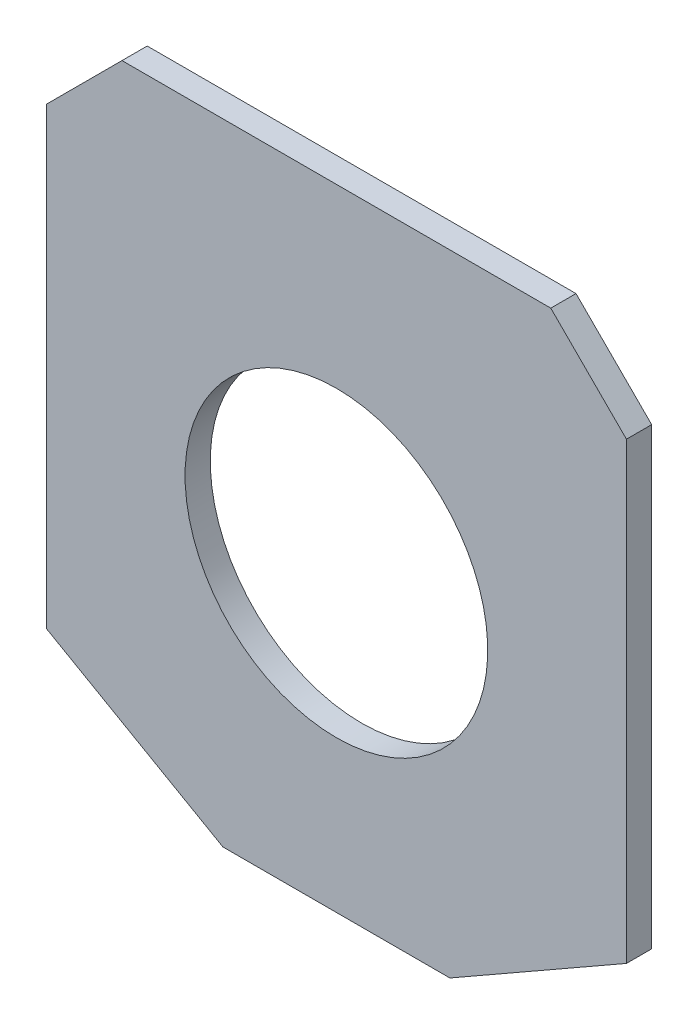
ISO-10303-21;
HEADER;
FILE_DESCRIPTION(('STEP AP214'),'2;1');
FILE_NAME('part.step','',(''),(''),'','','');
FILE_SCHEMA(('AUTOMOTIVE_DESIGN { 1 0 10303 214 1 1 1 1 }'));
ENDSEC;
DATA;
#1=APPLICATION_CONTEXT('core data for automotive mechanical design processes');
#2=APPLICATION_PROTOCOL_DEFINITION('international standard','automotive_design',2000,#1);
#3=PRODUCT_CONTEXT('',#1,'mechanical');
#4=PRODUCT('Part','Part','',(#3));
#5=PRODUCT_RELATED_PRODUCT_CATEGORY('part','',(#4));
#6=PRODUCT_DEFINITION_FORMATION('','',#4);
#7=PRODUCT_DEFINITION_CONTEXT('part definition',#1,'design');
#8=PRODUCT_DEFINITION('design','',#6,#7);
#9=PRODUCT_DEFINITION_SHAPE('','',#8);
#10=(LENGTH_UNIT() NAMED_UNIT(*) SI_UNIT(.MILLI.,.METRE.));
#11=(NAMED_UNIT(*) PLANE_ANGLE_UNIT() SI_UNIT($,.RADIAN.));
#12=(NAMED_UNIT(*) SI_UNIT($,.STERADIAN.) SOLID_ANGLE_UNIT());
#13=UNCERTAINTY_MEASURE_WITH_UNIT(LENGTH_MEASURE(1.E-05),#10,'distance_accuracy_value','');
#14=(GEOMETRIC_REPRESENTATION_CONTEXT(3) GLOBAL_UNCERTAINTY_ASSIGNED_CONTEXT((#13)) GLOBAL_UNIT_ASSIGNED_CONTEXT((#10,
#11,#12)) REPRESENTATION_CONTEXT('',''));
#15=CARTESIAN_POINT('',(0.,0.,0.));
#16=DIRECTION('',(0.,0.,1.));
#17=DIRECTION('',(1.,0.,0.));
#18=AXIS2_PLACEMENT_3D('',#15,#16,#17);
#19=CARTESIAN_POINT('',(83.011527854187,-96.2278115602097,0.));
#20=DIRECTION('',(0.,0.,1.));
#21=DIRECTION('',(1.,0.,0.));
#22=AXIS2_PLACEMENT_3D('',#19,#20,#21);
#23=PLANE('',#22);
#24=CARTESIAN_POINT('',(83.011527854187,-106.08069009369,0.));
#25=DIRECTION('',(0.,0.,-1.));
#26=DIRECTION('',(0.,1.,0.));
#27=AXIS2_PLACEMENT_3D('',#24,#25,#26);
#28=CIRCLE('',#27,60.);
#29=CARTESIAN_POINT('',(83.011527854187,-46.0806900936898,0.));
#30=VERTEX_POINT('',#29);
#31=EDGE_CURVE('E20',#30,#30,#28,.F.);
#32=ORIENTED_EDGE('',*,*,#31,.T.);
#33=EDGE_LOOP('',(#32));
#34=FACE_BOUND('',#33,.T.);
#35=DIRECTION('',(0.,1.,0.));
#36=VECTOR('',#35,1.);
#37=CARTESIAN_POINT('',(-31.988472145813,-186.08069009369,0.));
#38=LINE('',#37,#36);
#39=CARTESIAN_POINT('',(-31.988472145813,-6.08069009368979,0.));
#40=VERTEX_POINT('',#39);
#41=CARTESIAN_POINT('',(-31.988472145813,-186.08069009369,0.));
#42=VERTEX_POINT('',#41);
#43=EDGE_CURVE('E67',#40,#42,#38,.F.);
#44=ORIENTED_EDGE('',*,*,#43,.F.);
#45=DIRECTION('',(-0.707106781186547,-0.707106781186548,0.));
#46=VECTOR('',#45,1.);
#47=CARTESIAN_POINT('',(-31.988472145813,-6.08069009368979,0.));
#48=LINE('',#47,#46);
#49=CARTESIAN_POINT('',(-1.98847214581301,23.9193099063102,0.));
#50=VERTEX_POINT('',#49);
#51=EDGE_CURVE('E128',#50,#40,#48,.T.);
#52=ORIENTED_EDGE('',*,*,#51,.F.);
#53=DIRECTION('',(1.,0.,0.));
#54=VECTOR('',#53,1.);
#55=CARTESIAN_POINT('',(-1.98847214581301,23.9193099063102,0.));
#56=LINE('',#55,#54);
#57=CARTESIAN_POINT('',(168.011527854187,23.9193099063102,0.));
#58=VERTEX_POINT('',#57);
#59=EDGE_CURVE('E123',#58,#50,#56,.F.);
#60=ORIENTED_EDGE('',*,*,#59,.F.);
#61=DIRECTION('',(-0.707106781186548,0.707106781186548,0.));
#62=VECTOR('',#61,1.);
#63=CARTESIAN_POINT('',(168.011527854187,23.9193099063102,0.));
#64=LINE('',#63,#62);
#65=CARTESIAN_POINT('',(198.011527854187,-6.08069009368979,0.));
#66=VERTEX_POINT('',#65);
#67=EDGE_CURVE('E118',#66,#58,#64,.T.);
#68=ORIENTED_EDGE('',*,*,#67,.F.);
#69=DIRECTION('',(0.,1.,0.));
#70=VECTOR('',#69,1.);
#71=CARTESIAN_POINT('',(198.011527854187,-6.08069009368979,0.));
#72=LINE('',#71,#70);
#73=CARTESIAN_POINT('',(198.011527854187,-186.08069009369,0.));
#74=VERTEX_POINT('',#73);
#75=EDGE_CURVE('E113',#74,#66,#72,.T.);
#76=ORIENTED_EDGE('',*,*,#75,.F.);
#77=DIRECTION('',(0.868243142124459,0.496138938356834,0.));
#78=VECTOR('',#77,1.);
#79=CARTESIAN_POINT('',(198.011527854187,-186.08069009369,0.));
#80=LINE('',#79,#78);
#81=CARTESIAN_POINT('',(128.011527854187,-226.08069009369,0.));
#82=VERTEX_POINT('',#81);
#83=EDGE_CURVE('E108',#82,#74,#80,.T.);
#84=ORIENTED_EDGE('',*,*,#83,.F.);
#85=DIRECTION('',(1.,0.,0.));
#86=VECTOR('',#85,1.);
#87=CARTESIAN_POINT('',(128.011527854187,-226.08069009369,0.));
#88=LINE('',#87,#86);
#89=CARTESIAN_POINT('',(38.011527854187,-226.08069009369,0.));
#90=VERTEX_POINT('',#89);
#91=EDGE_CURVE('E95',#90,#82,#88,.T.);
#92=ORIENTED_EDGE('',*,*,#91,.F.);
#93=DIRECTION('',(0.868243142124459,-0.496138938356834,0.));
#94=VECTOR('',#93,1.);
#95=CARTESIAN_POINT('',(38.011527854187,-226.08069009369,0.));
#96=LINE('',#95,#94);
#97=EDGE_CURVE('E93',#42,#90,#96,.T.);
#98=ORIENTED_EDGE('',*,*,#97,.F.);
#99=EDGE_LOOP('',(#44,#52,#60,#68,#76,#84,#92,#98));
#100=FACE_BOUND('',#99,.T.);
#101=ADVANCED_FACE('F16',(#34,#100),#23,.F.);
#102=CARTESIAN_POINT('',(-31.988472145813,-186.08069009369,0.));
#103=DIRECTION('',(-1.,0.,0.));
#104=DIRECTION('',(0.,0.,1.));
#105=AXIS2_PLACEMENT_3D('',#102,#103,#104);
#106=PLANE('',#105);
#107=ORIENTED_EDGE('',*,*,#43,.T.);
#108=DIRECTION('',(0.,0.,1.));
#109=VECTOR('',#108,1.);
#110=CARTESIAN_POINT('',(-31.988472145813,-186.08069009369,0.));
#111=LINE('',#110,#109);
#112=CARTESIAN_POINT('',(-31.988472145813,-186.08069009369,10.));
#113=VERTEX_POINT('',#112);
#114=EDGE_CURVE('E87',#113,#42,#111,.F.);
#115=ORIENTED_EDGE('',*,*,#114,.F.);
#116=DIRECTION('',(0.,1.,0.));
#117=VECTOR('',#116,1.);
#118=CARTESIAN_POINT('',(-31.988472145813,-96.2278115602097,10.));
#119=LINE('',#118,#117);
#120=CARTESIAN_POINT('',(-31.988472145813,-6.08069009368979,10.));
#121=VERTEX_POINT('',#120);
#122=EDGE_CURVE('E60',#121,#113,#119,.F.);
#123=ORIENTED_EDGE('',*,*,#122,.F.);
#124=DIRECTION('',(0.,0.,1.));
#125=VECTOR('',#124,1.);
#126=CARTESIAN_POINT('',(-31.988472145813,-6.08069009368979,0.));
#127=LINE('',#126,#125);
#128=EDGE_CURVE('E89',#40,#121,#127,.T.);
#129=ORIENTED_EDGE('',*,*,#128,.F.);
#130=EDGE_LOOP('',(#107,#115,#123,#129));
#131=FACE_BOUND('',#130,.T.);
#132=ADVANCED_FACE('F85',(#131),#106,.T.);
#133=CARTESIAN_POINT('',(38.011527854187,-226.08069009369,0.));
#134=DIRECTION('',(-0.496138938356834,-0.868243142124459,0.));
#135=DIRECTION('',(0.868243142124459,-0.496138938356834,0.));
#136=AXIS2_PLACEMENT_3D('',#133,#134,#135);
#137=PLANE('',#136);
#138=ORIENTED_EDGE('',*,*,#97,.T.);
#139=DIRECTION('',(0.,0.,-1.));
#140=VECTOR('',#139,1.);
#141=CARTESIAN_POINT('',(38.011527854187,-226.08069009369,0.));
#142=LINE('',#141,#140);
#143=CARTESIAN_POINT('',(38.011527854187,-226.08069009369,10.));
#144=VERTEX_POINT('',#143);
#145=EDGE_CURVE('E98',#144,#90,#142,.T.);
#146=ORIENTED_EDGE('',*,*,#145,.F.);
#147=DIRECTION('',(0.868243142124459,-0.496138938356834,0.));
#148=VECTOR('',#147,1.);
#149=CARTESIAN_POINT('',(-31.9884721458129,-186.08069009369,10.));
#150=LINE('',#149,#148);
#151=EDGE_CURVE('E102',#113,#144,#150,.T.);
#152=ORIENTED_EDGE('',*,*,#151,.F.);
#153=ORIENTED_EDGE('',*,*,#114,.T.);
#154=EDGE_LOOP('',(#138,#146,#152,#153));
#155=FACE_BOUND('',#154,.T.);
#156=ADVANCED_FACE('F100',(#155),#137,.T.);
#157=CARTESIAN_POINT('',(128.011527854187,-226.08069009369,0.));
#158=DIRECTION('',(0.,-1.,0.));
#159=DIRECTION('',(0.,0.,-1.));
#160=AXIS2_PLACEMENT_3D('',#157,#158,#159);
#161=PLANE('',#160);
#162=ORIENTED_EDGE('',*,*,#91,.T.);
#163=DIRECTION('',(0.,0.,1.));
#164=VECTOR('',#163,1.);
#165=CARTESIAN_POINT('',(128.011527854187,-226.08069009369,0.));
#166=LINE('',#165,#164);
#167=CARTESIAN_POINT('',(128.011527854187,-226.08069009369,10.));
#168=VERTEX_POINT('',#167);
#169=EDGE_CURVE('E106',#168,#82,#166,.F.);
#170=ORIENTED_EDGE('',*,*,#169,.F.);
#171=DIRECTION('',(1.,0.,0.));
#172=VECTOR('',#171,1.);
#173=CARTESIAN_POINT('',(83.011527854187,-226.08069009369,10.));
#174=LINE('',#173,#172);
#175=EDGE_CURVE('E145',#144,#168,#174,.T.);
#176=ORIENTED_EDGE('',*,*,#175,.F.);
#177=ORIENTED_EDGE('',*,*,#145,.T.);
#178=EDGE_LOOP('',(#162,#170,#176,#177));
#179=FACE_BOUND('',#178,.T.);
#180=ADVANCED_FACE('F181',(#179),#161,.T.);
#181=CARTESIAN_POINT('',(198.011527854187,-186.08069009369,0.));
#182=DIRECTION('',(0.496138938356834,-0.868243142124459,0.));
#183=DIRECTION('',(0.868243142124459,0.496138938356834,0.));
#184=AXIS2_PLACEMENT_3D('',#181,#182,#183);
#185=PLANE('',#184);
#186=ORIENTED_EDGE('',*,*,#83,.T.);
#187=DIRECTION('',(0.,0.,-1.));
#188=VECTOR('',#187,1.);
#189=CARTESIAN_POINT('',(198.011527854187,-186.08069009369,0.));
#190=LINE('',#189,#188);
#191=CARTESIAN_POINT('',(198.011527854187,-186.08069009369,10.));
#192=VERTEX_POINT('',#191);
#193=EDGE_CURVE('E110',#192,#74,#190,.T.);
#194=ORIENTED_EDGE('',*,*,#193,.F.);
#195=DIRECTION('',(0.868243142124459,0.496138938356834,0.));
#196=VECTOR('',#195,1.);
#197=CARTESIAN_POINT('',(128.011527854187,-226.08069009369,10.));
#198=LINE('',#197,#196);
#199=EDGE_CURVE('E142',#168,#192,#198,.T.);
#200=ORIENTED_EDGE('',*,*,#199,.F.);
#201=ORIENTED_EDGE('',*,*,#169,.T.);
#202=EDGE_LOOP('',(#186,#194,#200,#201));
#203=FACE_BOUND('',#202,.T.);
#204=ADVANCED_FACE('F178',(#203),#185,.T.);
#205=CARTESIAN_POINT('',(198.011527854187,-6.08069009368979,0.));
#206=DIRECTION('',(1.,0.,0.));
#207=DIRECTION('',(0.,0.,-1.));
#208=AXIS2_PLACEMENT_3D('',#205,#206,#207);
#209=PLANE('',#208);
#210=ORIENTED_EDGE('',*,*,#75,.T.);
#211=DIRECTION('',(0.,0.,1.));
#212=VECTOR('',#211,1.);
#213=CARTESIAN_POINT('',(198.011527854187,-6.0806900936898,0.));
#214=LINE('',#213,#212);
#215=CARTESIAN_POINT('',(198.011527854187,-6.08069009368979,10.));
#216=VERTEX_POINT('',#215);
#217=EDGE_CURVE('E115',#216,#66,#214,.F.);
#218=ORIENTED_EDGE('',*,*,#217,.F.);
#219=DIRECTION('',(0.,1.,0.));
#220=VECTOR('',#219,1.);
#221=CARTESIAN_POINT('',(198.011527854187,-96.2278115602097,10.));
#222=LINE('',#221,#220);
#223=EDGE_CURVE('E139',#192,#216,#222,.T.);
#224=ORIENTED_EDGE('',*,*,#223,.F.);
#225=ORIENTED_EDGE('',*,*,#193,.T.);
#226=EDGE_LOOP('',(#210,#218,#224,#225));
#227=FACE_BOUND('',#226,.T.);
#228=ADVANCED_FACE('F175',(#227),#209,.T.);
#229=CARTESIAN_POINT('',(168.011527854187,23.9193099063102,0.));
#230=DIRECTION('',(0.707106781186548,0.707106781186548,0.));
#231=DIRECTION('',(-0.707106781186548,0.707106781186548,0.));
#232=AXIS2_PLACEMENT_3D('',#229,#230,#231);
#233=PLANE('',#232);
#234=ORIENTED_EDGE('',*,*,#67,.T.);
#235=DIRECTION('',(0.,0.,1.));
#236=VECTOR('',#235,1.);
#237=CARTESIAN_POINT('',(168.011527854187,23.9193099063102,0.));
#238=LINE('',#237,#236);
#239=CARTESIAN_POINT('',(168.011527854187,23.9193099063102,10.));
#240=VERTEX_POINT('',#239);
#241=EDGE_CURVE('E120',#240,#58,#238,.F.);
#242=ORIENTED_EDGE('',*,*,#241,.F.);
#243=DIRECTION('',(-0.707106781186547,0.707106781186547,0.));
#244=VECTOR('',#243,1.);
#245=CARTESIAN_POINT('',(198.011527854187,-6.08069009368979,10.));
#246=LINE('',#245,#244);
#247=EDGE_CURVE('E136',#216,#240,#246,.T.);
#248=ORIENTED_EDGE('',*,*,#247,.F.);
#249=ORIENTED_EDGE('',*,*,#217,.T.);
#250=EDGE_LOOP('',(#234,#242,#248,#249));
#251=FACE_BOUND('',#250,.T.);
#252=ADVANCED_FACE('F170',(#251),#233,.T.);
#253=CARTESIAN_POINT('',(-1.98847214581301,23.9193099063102,0.));
#254=DIRECTION('',(0.,1.,0.));
#255=DIRECTION('',(0.,0.,1.));
#256=AXIS2_PLACEMENT_3D('',#253,#254,#255);
#257=PLANE('',#256);
#258=ORIENTED_EDGE('',*,*,#59,.T.);
#259=DIRECTION('',(0.,0.,1.));
#260=VECTOR('',#259,1.);
#261=CARTESIAN_POINT('',(-1.98847214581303,23.9193099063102,0.));
#262=LINE('',#261,#260);
#263=CARTESIAN_POINT('',(-1.98847214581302,23.9193099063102,10.));
#264=VERTEX_POINT('',#263);
#265=EDGE_CURVE('E34',#264,#50,#262,.F.);
#266=ORIENTED_EDGE('',*,*,#265,.F.);
#267=DIRECTION('',(1.,0.,0.));
#268=VECTOR('',#267,1.);
#269=CARTESIAN_POINT('',(83.011527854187,23.9193099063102,10.));
#270=LINE('',#269,#268);
#271=EDGE_CURVE('E133',#240,#264,#270,.F.);
#272=ORIENTED_EDGE('',*,*,#271,.F.);
#273=ORIENTED_EDGE('',*,*,#241,.T.);
#274=EDGE_LOOP('',(#258,#266,#272,#273));
#275=FACE_BOUND('',#274,.T.);
#276=ADVANCED_FACE('F163',(#275),#257,.T.);
#277=CARTESIAN_POINT('',(-31.988472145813,-6.08069009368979,0.));
#278=DIRECTION('',(-0.707106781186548,0.707106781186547,0.));
#279=DIRECTION('',(-0.707106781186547,-0.707106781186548,0.));
#280=AXIS2_PLACEMENT_3D('',#277,#278,#279);
#281=PLANE('',#280);
#282=ORIENTED_EDGE('',*,*,#51,.T.);
#283=ORIENTED_EDGE('',*,*,#128,.T.);
#284=DIRECTION('',(-0.707106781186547,-0.707106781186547,0.));
#285=VECTOR('',#284,1.);
#286=CARTESIAN_POINT('',(-1.98847214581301,23.9193099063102,10.));
#287=LINE('',#286,#285);
#288=EDGE_CURVE('E26',#264,#121,#287,.T.);
#289=ORIENTED_EDGE('',*,*,#288,.F.);
#290=ORIENTED_EDGE('',*,*,#265,.T.);
#291=EDGE_LOOP('',(#282,#283,#289,#290));
#292=FACE_BOUND('',#291,.T.);
#293=ADVANCED_FACE('F156',(#292),#281,.T.);
#294=CARTESIAN_POINT('',(83.011527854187,-106.08069009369,10.));
#295=DIRECTION('',(0.,0.,-1.));
#296=DIRECTION('',(0.,1.,0.));
#297=AXIS2_PLACEMENT_3D('',#294,#295,#296);
#298=CYLINDRICAL_SURFACE('',#297,60.);
#299=CARTESIAN_POINT('',(83.011527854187,-106.08069009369,10.));
#300=DIRECTION('',(0.,0.,-1.));
#301=DIRECTION('',(0.,1.,0.));
#302=AXIS2_PLACEMENT_3D('',#299,#300,#301);
#303=CIRCLE('',#302,60.);
#304=CARTESIAN_POINT('',(83.011527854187,-46.0806900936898,10.));
#305=VERTEX_POINT('',#304);
#306=EDGE_CURVE('E10',#305,#305,#303,.T.);
#307=ORIENTED_EDGE('',*,*,#306,.F.);
#308=EDGE_LOOP('',(#307));
#309=FACE_BOUND('',#308,.T.);
#310=ORIENTED_EDGE('',*,*,#31,.F.);
#311=EDGE_LOOP('',(#310));
#312=FACE_BOUND('',#311,.T.);
#313=ADVANCED_FACE('F18',(#309,#312),#298,.F.);
#314=CARTESIAN_POINT('',(83.011527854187,-96.2278115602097,10.));
#315=DIRECTION('',(0.,0.,1.));
#316=DIRECTION('',(1.,0.,0.));
#317=AXIS2_PLACEMENT_3D('',#314,#315,#316);
#318=PLANE('',#317);
#319=ORIENTED_EDGE('',*,*,#306,.T.);
#320=EDGE_LOOP('',(#319));
#321=FACE_BOUND('',#320,.T.);
#322=ORIENTED_EDGE('',*,*,#271,.T.);
#323=ORIENTED_EDGE('',*,*,#288,.T.);
#324=ORIENTED_EDGE('',*,*,#122,.T.);
#325=ORIENTED_EDGE('',*,*,#151,.T.);
#326=ORIENTED_EDGE('',*,*,#175,.T.);
#327=ORIENTED_EDGE('',*,*,#199,.T.);
#328=ORIENTED_EDGE('',*,*,#223,.T.);
#329=ORIENTED_EDGE('',*,*,#247,.T.);
#330=EDGE_LOOP('',(#322,#323,#324,#325,#326,#327,#328,#329));
#331=FACE_BOUND('',#330,.T.);
#332=ADVANCED_FACE('F155',(#321,#331),#318,.T.);
#333=CLOSED_SHELL('',(#101,#132,#156,#180,#204,#228,#252,#276,#293,#313,#332));
#334=MANIFOLD_SOLID_BREP('B1',#333);
#335=ADVANCED_BREP_SHAPE_REPRESENTATION('',(#18,#334),#14);
#336=SHAPE_DEFINITION_REPRESENTATION(#9,#335);
ENDSEC;
END-ISO-10303-21;
